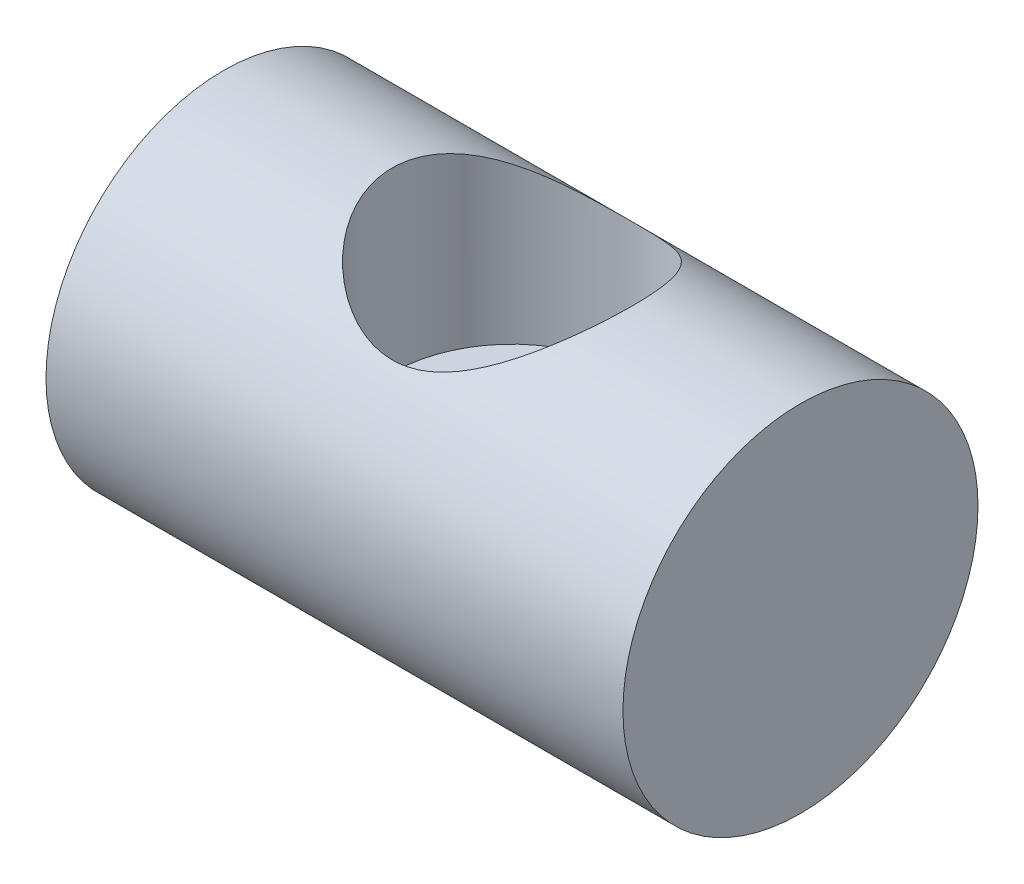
from build123d import *

# Parameters (mm, degrees)
SKIZZE1_R                                            = 10
AUFSATZ_LINEAR_AUSTRAGEN1_DEPTH                      = 16.25
STIRNSENKUNG_F_R_M8_ZYLINDERSCHRAUBE_MIT_D           = 8.5
STIRNSENKUNG_F_R_M8_ZYLINDERSCHRAUBE_MIT_CBORE_D     = 13.5
STIRNSENKUNG_F_R_M8_ZYLINDERSCHRAUBE_MIT_CBORE_DEPTH = 10


with BuildPart() as part:
    # Skizze1 → Aufsatz-Linear austragen1 (new, symmetric)
    with BuildSketch(Plane(origin=(0, 0, 0), x_dir=(0, 0, -1), z_dir=(1, 0, 0))):
        Circle(SKIZZE1_R)
    extrude(amount=AUFSATZ_LINEAR_AUSTRAGEN1_DEPTH, both=True)

    # Stirnsenkung f_r M8 Zylinderschraube mit (through all)
    with Locations(Plane.ZX.offset(10)):
        with Locations((0, 0)):
            CounterBoreHole(STIRNSENKUNG_F_R_M8_ZYLINDERSCHRAUBE_MIT_D / 2, STIRNSENKUNG_F_R_M8_ZYLINDERSCHRAUBE_MIT_CBORE_D / 2, STIRNSENKUNG_F_R_M8_ZYLINDERSCHRAUBE_MIT_CBORE_DEPTH)


solid = part.part
